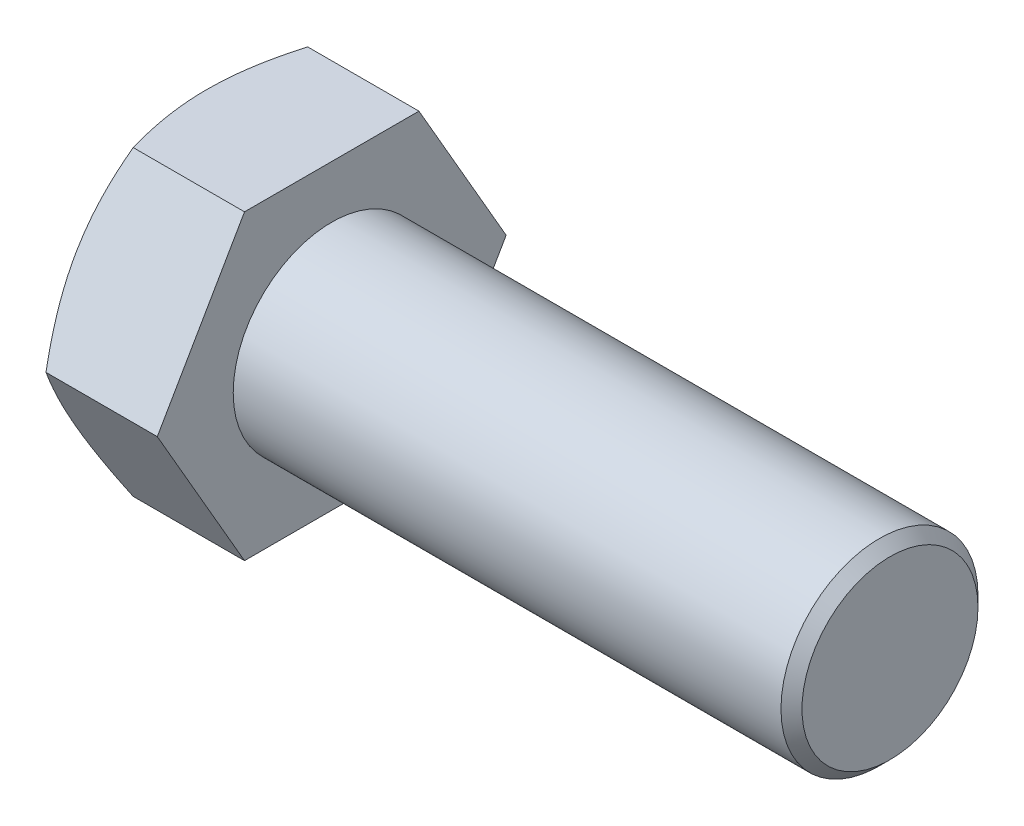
ISO-10303-21;
HEADER;
FILE_DESCRIPTION(('STEP AP214'),'2;1');
FILE_NAME('part.step','',(''),(''),'','','');
FILE_SCHEMA(('AUTOMOTIVE_DESIGN { 1 0 10303 214 1 1 1 1 }'));
ENDSEC;
DATA;
#1=APPLICATION_CONTEXT('core data for automotive mechanical design processes');
#2=APPLICATION_PROTOCOL_DEFINITION('international standard','automotive_design',2000,#1);
#3=PRODUCT_CONTEXT('',#1,'mechanical');
#4=PRODUCT('Part','Part','',(#3));
#5=PRODUCT_RELATED_PRODUCT_CATEGORY('part','',(#4));
#6=PRODUCT_DEFINITION_FORMATION('','',#4);
#7=PRODUCT_DEFINITION_CONTEXT('part definition',#1,'design');
#8=PRODUCT_DEFINITION('design','',#6,#7);
#9=PRODUCT_DEFINITION_SHAPE('','',#8);
#10=(LENGTH_UNIT() NAMED_UNIT(*) SI_UNIT(.MILLI.,.METRE.));
#11=(NAMED_UNIT(*) PLANE_ANGLE_UNIT() SI_UNIT($,.RADIAN.));
#12=(NAMED_UNIT(*) SI_UNIT($,.STERADIAN.) SOLID_ANGLE_UNIT());
#13=UNCERTAINTY_MEASURE_WITH_UNIT(LENGTH_MEASURE(1.E-05),#10,'distance_accuracy_value','');
#14=(GEOMETRIC_REPRESENTATION_CONTEXT(3) GLOBAL_UNCERTAINTY_ASSIGNED_CONTEXT((#13)) GLOBAL_UNIT_ASSIGNED_CONTEXT((#10,
#11,#12)) REPRESENTATION_CONTEXT('',''));
#15=CARTESIAN_POINT('',(0.,0.,0.));
#16=DIRECTION('',(0.,0.,1.));
#17=DIRECTION('',(1.,0.,0.));
#18=AXIS2_PLACEMENT_3D('',#15,#16,#17);
#19=CARTESIAN_POINT('',(-19.,-23.,-13.2790561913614));
#20=DIRECTION('',(0.,-0.499999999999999,-0.866025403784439));
#21=DIRECTION('',(0.,0.866025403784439,-0.499999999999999));
#22=AXIS2_PLACEMENT_3D('',#19,#20,#21);
#23=PLANE('',#22);
#24=DIRECTION('',(1.,0.,0.));
#25=VECTOR('',#24,1.);
#26=CARTESIAN_POINT('',(-19.,-23.,-13.2790561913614));
#27=LINE('',#26,#25);
#28=CARTESIAN_POINT('',(-16.9457228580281,-23.,-13.2790561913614));
#29=VERTEX_POINT('',#28);
#30=CARTESIAN_POINT('',(0.,-23.,-13.2790561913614));
#31=VERTEX_POINT('',#30);
#32=EDGE_CURVE('E239',#29,#31,#27,.T.);
#33=ORIENTED_EDGE('',*,*,#32,.F.);
#34=CARTESIAN_POINT('',(-16.9456561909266,-23.0002,-13.2789407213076));
#35=CARTESIAN_POINT('',(-17.1141540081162,-22.4946699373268,-13.5708086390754));
#36=CARTESIAN_POINT('',(-17.2750056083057,-21.9871680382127,-13.8638149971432));
#37=CARTESIAN_POINT('',(-17.5792910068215,-20.9680946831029,-14.4521772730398));
#38=CARTESIAN_POINT('',(-17.7227190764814,-20.4565219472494,-14.7475339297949));
#39=CARTESIAN_POINT('',(-17.990232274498,-19.4283073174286,-15.3411739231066));
#40=CARTESIAN_POINT('',(-18.1142712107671,-18.9116563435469,-15.6394625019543));
#41=CARTESIAN_POINT('',(-18.3403340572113,-17.874786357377,-16.2380996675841));
#42=CARTESIAN_POINT('',(-18.442360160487,-17.3545677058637,-16.5384480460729));
#43=CARTESIAN_POINT('',(-18.6200664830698,-16.3238595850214,-17.1335276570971));
#44=CARTESIAN_POINT('',(-18.6963343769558,-15.8134465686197,-17.4282147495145));
#45=CARTESIAN_POINT('',(-18.8242182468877,-14.7902817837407,-18.0189392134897));
#46=CARTESIAN_POINT('',(-18.8758337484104,-14.2775299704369,-18.3149766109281));
#47=CARTESIAN_POINT('',(-18.9531095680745,-13.2511650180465,-18.9075486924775));
#48=CARTESIAN_POINT('',(-18.9788007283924,-12.737553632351,-19.2040823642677));
#49=CARTESIAN_POINT('',(-19.0036753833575,-11.709856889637,-19.7974233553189));
#50=CARTESIAN_POINT('',(-19.0028596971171,-11.1957715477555,-20.0942306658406));
#51=CARTESIAN_POINT('',(-18.9765720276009,-10.2346805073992,-20.6491168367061));
#52=CARTESIAN_POINT('',(-18.9543055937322,-9.78760635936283,-20.9072352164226));
#53=CARTESIAN_POINT('',(-18.8901483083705,-8.89452539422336,-21.422855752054));
#54=CARTESIAN_POINT('',(-18.8482577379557,-8.44851856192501,-21.6803579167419));
#55=CARTESIAN_POINT('',(-18.7455781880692,-7.5577370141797,-22.1946508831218));
#56=CARTESIAN_POINT('',(-18.6847721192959,-7.11296378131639,-22.4514408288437));
#57=CARTESIAN_POINT('',(-18.5453377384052,-6.22554696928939,-22.9637911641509));
#58=CARTESIAN_POINT('',(-18.4667095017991,-5.78290338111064,-23.219351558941));
#59=CARTESIAN_POINT('',(-18.2020736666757,-4.43913170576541,-23.9951784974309));
#60=CARTESIAN_POINT('',(-17.9896645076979,-3.54182151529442,-24.513240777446));
#61=CARTESIAN_POINT('',(-17.6280478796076,-2.20576568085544,-25.2846129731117));
#62=CARTESIAN_POINT('',(-17.5004719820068,-1.76244815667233,-25.5405624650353));
#63=CARTESIAN_POINT('',(-17.2324046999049,-0.878879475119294,-26.0506910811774));
#64=CARTESIAN_POINT('',(-17.0919169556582,-0.438627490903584,-26.3048706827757));
#65=CARTESIAN_POINT('',(-16.9456561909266,0.000200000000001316,-26.5582278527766));
#66=B_SPLINE_CURVE_WITH_KNOTS('',3,(#34,#35,#36,#37,#38,#39,#40,#41,#42,#43,#44,#45,#46,#47,#48,
#49,#50,#51,#52,#53,#54,#55,#56,#57,#58,#59,#60,#61,#62,#63,#64,#65),.UNSPECIFIED.,.F.,.F.,(4,2,
2,2,2,2,2,2,2,2,2,2,2,2,2,4),(0.,1.8227520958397,3.64610187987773,5.47373144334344,
7.30117883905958,9.08355891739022,10.8659733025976,12.6462646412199,14.4265009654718,
15.9762768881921,17.5260306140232,19.0771885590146,20.6283399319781,23.7989683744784,
25.381520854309,26.9636285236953),.UNSPECIFIED.);
#67=CARTESIAN_POINT('',(-19.,-11.5,-19.9185842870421));
#68=VERTEX_POINT('',#67);
#69=EDGE_CURVE('E172',#29,#68,#66,.T.);
#70=ORIENTED_EDGE('',*,*,#69,.T.);
#71=CARTESIAN_POINT('',(-16.9457228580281,0.,-26.5581123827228));
#72=VERTEX_POINT('',#71);
#73=EDGE_CURVE('E166',#68,#72,#66,.T.);
#74=ORIENTED_EDGE('',*,*,#73,.T.);
#75=DIRECTION('',(1.,0.,0.));
#76=VECTOR('',#75,1.);
#77=CARTESIAN_POINT('',(-19.,0.,-26.5581123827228));
#78=LINE('',#77,#76);
#79=CARTESIAN_POINT('',(0.,0.,-26.5581123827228));
#80=VERTEX_POINT('',#79);
#81=EDGE_CURVE('E245',#72,#80,#78,.T.);
#82=ORIENTED_EDGE('',*,*,#81,.T.);
#83=DIRECTION('',(0.,0.866025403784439,-0.499999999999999));
#84=VECTOR('',#83,1.);
#85=CARTESIAN_POINT('',(0.,-23.,-13.2790561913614));
#86=LINE('',#85,#84);
#87=EDGE_CURVE('E269',#31,#80,#86,.T.);
#88=ORIENTED_EDGE('',*,*,#87,.F.);
#89=EDGE_LOOP('',(#33,#70,#74,#82,#88));
#90=FACE_BOUND('',#89,.T.);
#91=ADVANCED_FACE('F37',(#90),#23,.T.);
#92=CARTESIAN_POINT('',(-19.,-23.,13.2790561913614));
#93=DIRECTION('',(0.,-1.,0.));
#94=DIRECTION('',(0.,0.,-1.));
#95=AXIS2_PLACEMENT_3D('',#92,#93,#94);
#96=PLANE('',#95);
#97=DIRECTION('',(1.,0.,0.));
#98=VECTOR('',#97,1.);
#99=CARTESIAN_POINT('',(-19.,-23.,13.2790561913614));
#100=LINE('',#99,#98);
#101=CARTESIAN_POINT('',(-16.9457228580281,-23.,13.2790561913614));
#102=VERTEX_POINT('',#101);
#103=CARTESIAN_POINT('',(0.,-23.,13.2790561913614));
#104=VERTEX_POINT('',#103);
#105=EDGE_CURVE('E236',#102,#104,#100,.T.);
#106=ORIENTED_EDGE('',*,*,#105,.F.);
#107=CARTESIAN_POINT('',(-7.48739623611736,-23.,-36.261263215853));
#108=CARTESIAN_POINT('',(-7.73354565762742,-23.,-35.7563800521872));
#109=CARTESIAN_POINT('',(-7.97851134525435,-23.,-35.2509202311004));
#110=CARTESIAN_POINT('',(-8.46580863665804,-23.,-34.2387268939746));
#111=CARTESIAN_POINT('',(-8.70814021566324,-23.,-33.7319933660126));
#112=CARTESIAN_POINT('',(-9.43084404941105,-23.,-32.2095745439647));
#113=CARTESIAN_POINT('',(-9.90685668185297,-23.,-31.191811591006));
#114=CARTESIAN_POINT('',(-10.8469186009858,-23.,-29.14441182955));
#115=CARTESIAN_POINT('',(-11.3108936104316,-23.,-28.1147408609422));
#116=CARTESIAN_POINT('',(-12.2206502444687,-23.,-26.0474043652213));
#117=CARTESIAN_POINT('',(-12.6664326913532,-23.,-25.0097392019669));
#118=CARTESIAN_POINT('',(-13.3251922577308,-23.,-23.4283078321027));
#119=CARTESIAN_POINT('',(-13.5466205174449,-23.,-22.888058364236));
#120=CARTESIAN_POINT('',(-13.9824654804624,-23.,-21.8047417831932));
#121=CARTESIAN_POINT('',(-14.196882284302,-23.,-21.2616747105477));
#122=CARTESIAN_POINT('',(-14.6177870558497,-23.,-20.1723832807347));
#123=CARTESIAN_POINT('',(-14.8242739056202,-23.,-19.6261584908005));
#124=CARTESIAN_POINT('',(-15.2281815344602,-23.,-18.5303754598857));
#125=CARTESIAN_POINT('',(-15.4256025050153,-23.,-17.9808172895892));
#126=CARTESIAN_POINT('',(-15.8097601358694,-23.,-16.8791447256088));
#127=CARTESIAN_POINT('',(-15.996516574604,-23.,-16.3270372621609));
#128=CARTESIAN_POINT('',(-16.3583193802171,-23.,-15.2190090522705));
#129=CARTESIAN_POINT('',(-16.5333655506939,-23.,-14.6630882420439));
#130=CARTESIAN_POINT('',(-17.0385069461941,-23.,-12.9895415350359));
#131=CARTESIAN_POINT('',(-17.3487486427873,-23.,-11.8657263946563));
#132=CARTESIAN_POINT('',(-17.7625410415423,-23.,-10.1709040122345));
#133=CARTESIAN_POINT('',(-17.8915832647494,-23.,-9.60606069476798));
#134=CARTESIAN_POINT('',(-18.1309904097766,-23.,-8.47240461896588));
#135=CARTESIAN_POINT('',(-18.2413556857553,-23.,-7.90359193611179));
#136=CARTESIAN_POINT('',(-18.4414969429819,-23.,-6.76236589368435));
#137=CARTESIAN_POINT('',(-18.5312738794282,-23.,-6.18995270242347));
#138=CARTESIAN_POINT('',(-18.6884786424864,-23.,-5.04204443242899));
#139=CARTESIAN_POINT('',(-18.7559064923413,-23.,-4.46654935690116));
#140=CARTESIAN_POINT('',(-18.8661876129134,-23.,-3.32108847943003));
#141=CARTESIAN_POINT('',(-18.9093624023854,-23.,-2.75115382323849));
#142=CARTESIAN_POINT('',(-18.9715475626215,-23.,-1.60996833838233));
#143=CARTESIAN_POINT('',(-18.99055835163,-23.,-1.03871753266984));
#144=CARTESIAN_POINT('',(-19.0039602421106,-23.,0.104081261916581));
#145=CARTESIAN_POINT('',(-18.9983512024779,-23.,0.675629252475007));
#146=CARTESIAN_POINT('',(-18.9626559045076,-23.,1.81796798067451));
#147=CARTESIAN_POINT('',(-18.9325685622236,-23.,2.38875868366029));
#148=CARTESIAN_POINT('',(-18.8328155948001,-23.,3.74276967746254));
#149=CARTESIAN_POINT('',(-18.7525264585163,-23.,4.5252222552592));
#150=CARTESIAN_POINT('',(-18.550184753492,-23.,6.08471078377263));
#151=CARTESIAN_POINT('',(-18.4281270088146,-23.,6.8617460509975));
#152=CARTESIAN_POINT('',(-18.1465893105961,-23.,8.40951343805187));
#153=CARTESIAN_POINT('',(-17.9870827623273,-23.,9.18024067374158));
#154=CARTESIAN_POINT('',(-17.6355424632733,-23.,10.7141618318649));
#155=CARTESIAN_POINT('',(-17.4435090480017,-23.,11.4773558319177));
#156=CARTESIAN_POINT('',(-17.0268215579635,-23.,13.0139505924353));
#157=CARTESIAN_POINT('',(-16.8015084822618,-23.,13.7871714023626));
#158=CARTESIAN_POINT('',(-16.3263798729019,-23.,15.3260034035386));
#159=CARTESIAN_POINT('',(-16.0765641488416,-23.,16.0916145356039));
#160=CARTESIAN_POINT('',(-15.5565000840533,-23.,17.6156011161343));
#161=CARTESIAN_POINT('',(-15.2862574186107,-23.,18.3739785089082));
#162=CARTESIAN_POINT('',(-14.8680485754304,-23.,19.5067594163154));
#163=CARTESIAN_POINT('',(-14.7265056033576,-23.,19.8835535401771));
#164=CARTESIAN_POINT('',(-14.4394918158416,-23.,20.6356444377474));
#165=CARTESIAN_POINT('',(-14.2940209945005,-23.,21.0109412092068));
#166=CARTESIAN_POINT('',(-13.8940127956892,-23.,22.0284195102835));
#167=CARTESIAN_POINT('',(-13.6359834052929,-23.,22.6692292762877));
#168=CARTESIAN_POINT('',(-13.1108265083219,-23.,23.9471174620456));
#169=CARTESIAN_POINT('',(-12.8436987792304,-23.,24.5841957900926));
#170=CARTESIAN_POINT('',(-12.3015656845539,-23.,25.8550522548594));
#171=CARTESIAN_POINT('',(-12.026559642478,-23.,26.48883010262));
#172=CARTESIAN_POINT('',(-11.4697355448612,-23.,27.7533904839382));
#173=CARTESIAN_POINT('',(-11.1879174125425,-23.,28.3841729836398));
#174=CARTESIAN_POINT('',(-10.6182482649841,-23.,29.6432932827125));
#175=CARTESIAN_POINT('',(-10.3303950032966,-23.,30.2716300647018));
#176=CARTESIAN_POINT('',(-9.7495013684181,-23.,31.5259030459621));
#177=CARTESIAN_POINT('',(-9.45646096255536,-23.,32.1518392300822));
#178=CARTESIAN_POINT('',(-8.57056874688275,-23.,34.0263673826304));
#179=CARTESIAN_POINT('',(-7.97091511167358,-23.,35.27174670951));
#180=CARTESIAN_POINT('',(-6.75651841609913,-23.,37.7576286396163));
#181=CARTESIAN_POINT('',(-6.1417522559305,-23.,38.9981199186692));
#182=CARTESIAN_POINT('',(-4.90100524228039,-23.,41.4734876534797));
#183=CARTESIAN_POINT('',(-4.27502429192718,-23.,42.7083640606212));
#184=CARTESIAN_POINT('',(-3.01420487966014,-23.,45.1732321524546));
#185=CARTESIAN_POINT('',(-2.37936842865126,-23.,46.4032248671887));
#186=CARTESIAN_POINT('',(-1.10237855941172,-23.,48.8593975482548));
#187=CARTESIAN_POINT('',(-0.460225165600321,-23.,50.0855775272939));
#188=CARTESIAN_POINT('',(0.761157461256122,-23.,52.4038849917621));
#189=CARTESIAN_POINT('',(1.33977706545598,-23.,53.4963339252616));
#190=CARTESIAN_POINT('',(2.50110248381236,-23.,55.6790584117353));
#191=CARTESIAN_POINT('',(3.08380830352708,-23.,56.7693339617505));
#192=CARTESIAN_POINT('',(4.83720692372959,-23.,60.0374991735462));
#193=CARTESIAN_POINT('',(6.01311044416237,-23.,62.2125940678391));
#194=CARTESIAN_POINT('',(7.78271585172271,-23.,65.4673040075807));
#195=CARTESIAN_POINT('',(8.37252764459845,-23.,66.5490393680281));
#196=CARTESIAN_POINT('',(9.55441403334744,-23.,68.711274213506));
#197=CARTESIAN_POINT('',(10.1464886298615,-23.,69.7917736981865));
#198=CARTESIAN_POINT('',(11.3325686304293,-23.,71.9515989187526));
#199=CARTESIAN_POINT('',(11.9265738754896,-23.,73.0309247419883));
#200=CARTESIAN_POINT('',(13.1163368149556,-23.,75.188608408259));
#201=CARTESIAN_POINT('',(13.7120945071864,-23.,76.2669662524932));
#202=CARTESIAN_POINT('',(14.3086163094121,-23.,77.344900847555));
#203=B_SPLINE_CURVE_WITH_KNOTS('',3,(#107,#108,#109,#110,#111,#112,#113,#114,#115,#116,#117,
#118,#119,#120,#121,#122,#123,#124,#125,#126,#127,#128,#129,#130,#131,#132,#133,#134,#135,#136,
#137,#138,#139,#140,#141,#142,#143,#144,#145,#146,#147,#148,#149,#150,#151,#152,#153,#154,#155,
#156,#157,#158,#159,#160,#161,#162,#163,#164,#165,#166,#167,#168,#169,#170,#171,#172,#173,#174,
#175,#176,#177,#178,#179,#180,#181,#182,#183,#184,#185,#186,#187,#188,#189,#190,#191,#192,#193,
#194,#195,#196,#197,#198,#199,#200,#201,#202),.UNSPECIFIED.,.F.,.F.,(4,2,2,2,2,2,2,2,2,2,2,2,2,
2,2,2,2,2,2,2,2,2,2,2,2,2,2,2,2,2,2,2,2,2,2,2,2,2,2,2,2,2,2,2,2,2,2,4),(0.,1.68506916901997,
3.37015417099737,6.74079357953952,10.12879996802,13.5166530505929,15.2682126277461,
17.0197470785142,18.7715275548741,20.5232710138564,22.2716524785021,24.0200632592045,
27.5155968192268,29.2535370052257,30.9914442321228,32.7292708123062,34.4670955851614,
36.1813030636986,37.8954808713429,39.6096685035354,41.3239320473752,43.6823245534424,
46.0410094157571,48.4013744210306,50.7617150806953,53.1773703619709,55.5930444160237,
58.0080497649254,59.2155396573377,60.4230313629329,62.4953687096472,64.5677567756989,
66.6403233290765,68.7129132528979,70.7862888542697,72.8596775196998,77.006231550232,
81.1595751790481,85.3129547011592,89.4654059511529,93.6178433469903,97.3265000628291,
101.035161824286,108.452937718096,112.149186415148,115.84543615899,119.541388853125,
123.237336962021),.UNSPECIFIED.);
#204=CARTESIAN_POINT('',(-19.,-23.,0.));
#205=VERTEX_POINT('',#204);
#206=EDGE_CURVE('E221',#102,#205,#203,.F.);
#207=ORIENTED_EDGE('',*,*,#206,.T.);
#208=EDGE_CURVE('E180',#205,#29,#203,.F.);
#209=ORIENTED_EDGE('',*,*,#208,.T.);
#210=ORIENTED_EDGE('',*,*,#32,.T.);
#211=DIRECTION('',(0.,0.,-1.));
#212=VECTOR('',#211,1.);
#213=CARTESIAN_POINT('',(0.,-23.,13.2790561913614));
#214=LINE('',#213,#212);
#215=EDGE_CURVE('E247',#104,#31,#214,.T.);
#216=ORIENTED_EDGE('',*,*,#215,.F.);
#217=EDGE_LOOP('',(#106,#207,#209,#210,#216));
#218=FACE_BOUND('',#217,.T.);
#219=ADVANCED_FACE('F163',(#218),#96,.T.);
#220=CARTESIAN_POINT('',(-19.,-23.,13.2790561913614));
#221=DIRECTION('',(0.,0.499999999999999,-0.866025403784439));
#222=DIRECTION('',(0.,0.866025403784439,0.499999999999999));
#223=AXIS2_PLACEMENT_3D('',#220,#221,#222);
#224=PLANE('',#223);
#225=CARTESIAN_POINT('',(-16.9456561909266,-23.0002,13.2789407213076));
#226=CARTESIAN_POINT('',(-17.1141540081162,-22.4946699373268,13.5708086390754));
#227=CARTESIAN_POINT('',(-17.2750056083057,-21.9871680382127,13.8638149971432));
#228=CARTESIAN_POINT('',(-17.5792910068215,-20.9680946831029,14.4521772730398));
#229=CARTESIAN_POINT('',(-17.7227190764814,-20.4565219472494,14.7475339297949));
#230=CARTESIAN_POINT('',(-17.990232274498,-19.4283073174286,15.3411739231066));
#231=CARTESIAN_POINT('',(-18.1142712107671,-18.9116563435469,15.6394625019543));
#232=CARTESIAN_POINT('',(-18.3403340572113,-17.874786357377,16.2380996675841));
#233=CARTESIAN_POINT('',(-18.442360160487,-17.3545677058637,16.5384480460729));
#234=CARTESIAN_POINT('',(-18.6200664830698,-16.3238595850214,17.1335276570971));
#235=CARTESIAN_POINT('',(-18.6963343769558,-15.8134465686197,17.4282147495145));
#236=CARTESIAN_POINT('',(-18.8242182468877,-14.7902817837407,18.0189392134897));
#237=CARTESIAN_POINT('',(-18.8758337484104,-14.2775299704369,18.3149766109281));
#238=CARTESIAN_POINT('',(-18.9531095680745,-13.2511650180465,18.9075486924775));
#239=CARTESIAN_POINT('',(-18.9788007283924,-12.737553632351,19.2040823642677));
#240=CARTESIAN_POINT('',(-19.0036753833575,-11.709856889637,19.7974233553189));
#241=CARTESIAN_POINT('',(-19.0028596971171,-11.1957715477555,20.0942306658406));
#242=CARTESIAN_POINT('',(-18.9765720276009,-10.2346805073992,20.6491168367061));
#243=CARTESIAN_POINT('',(-18.9543055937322,-9.78760635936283,20.9072352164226));
#244=CARTESIAN_POINT('',(-18.8901483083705,-8.89452539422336,21.422855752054));
#245=CARTESIAN_POINT('',(-18.8482577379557,-8.44851856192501,21.6803579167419));
#246=CARTESIAN_POINT('',(-18.7455781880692,-7.5577370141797,22.1946508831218));
#247=CARTESIAN_POINT('',(-18.6847721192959,-7.11296378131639,22.4514408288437));
#248=CARTESIAN_POINT('',(-18.5453377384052,-6.22554696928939,22.9637911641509));
#249=CARTESIAN_POINT('',(-18.4667095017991,-5.78290338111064,23.219351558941));
#250=CARTESIAN_POINT('',(-18.2020736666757,-4.43913170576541,23.9951784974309));
#251=CARTESIAN_POINT('',(-17.9896645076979,-3.54182151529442,24.513240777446));
#252=CARTESIAN_POINT('',(-17.6280478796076,-2.20576568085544,25.2846129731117));
#253=CARTESIAN_POINT('',(-17.5004719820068,-1.76244815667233,25.5405624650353));
#254=CARTESIAN_POINT('',(-17.2324046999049,-0.878879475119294,26.0506910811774));
#255=CARTESIAN_POINT('',(-17.0919169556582,-0.438627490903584,26.3048706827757));
#256=CARTESIAN_POINT('',(-16.9456561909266,0.000200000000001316,26.5582278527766));
#257=B_SPLINE_CURVE_WITH_KNOTS('',3,(#225,#226,#227,#228,#229,#230,#231,#232,#233,#234,#235,
#236,#237,#238,#239,#240,#241,#242,#243,#244,#245,#246,#247,#248,#249,#250,#251,#252,#253,#254,
#255,#256),.UNSPECIFIED.,.F.,.F.,(4,2,2,2,2,2,2,2,2,2,2,2,2,2,2,4),(0.,1.8227520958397,
3.64610187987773,5.47373144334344,7.30117883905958,9.08355891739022,10.8659733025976,
12.6462646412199,14.4265009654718,15.9762768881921,17.5260306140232,19.0771885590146,
20.6283399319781,23.7989683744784,25.381520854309,26.9636285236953),.UNSPECIFIED.);
#258=CARTESIAN_POINT('',(-19.,-11.5,19.9185842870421));
#259=VERTEX_POINT('',#258);
#260=EDGE_CURVE('E178',#102,#259,#257,.T.);
#261=ORIENTED_EDGE('',*,*,#260,.F.);
#262=ORIENTED_EDGE('',*,*,#105,.T.);
#263=DIRECTION('',(0.,0.866025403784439,0.499999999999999));
#264=VECTOR('',#263,1.);
#265=CARTESIAN_POINT('',(0.,-23.,13.2790561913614));
#266=LINE('',#265,#264);
#267=CARTESIAN_POINT('',(0.,0.,26.5581123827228));
#268=VERTEX_POINT('',#267);
#269=EDGE_CURVE('E232',#104,#268,#266,.T.);
#270=ORIENTED_EDGE('',*,*,#269,.T.);
#271=DIRECTION('',(1.,0.,0.));
#272=VECTOR('',#271,1.);
#273=CARTESIAN_POINT('',(-19.,0.,26.5581123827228));
#274=LINE('',#273,#272);
#275=CARTESIAN_POINT('',(-16.9457228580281,0.,26.5581123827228));
#276=VERTEX_POINT('',#275);
#277=EDGE_CURVE('E230',#276,#268,#274,.T.);
#278=ORIENTED_EDGE('',*,*,#277,.F.);
#279=EDGE_CURVE('E173',#259,#276,#257,.T.);
#280=ORIENTED_EDGE('',*,*,#279,.F.);
#281=EDGE_LOOP('',(#261,#262,#270,#278,#280));
#282=FACE_BOUND('',#281,.T.);
#283=ADVANCED_FACE('F186',(#282),#224,.F.);
#284=CARTESIAN_POINT('',(-19.,23.,13.2790561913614));
#285=DIRECTION('',(0.,0.499999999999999,0.866025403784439));
#286=DIRECTION('',(0.,-0.866025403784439,0.499999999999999));
#287=AXIS2_PLACEMENT_3D('',#284,#285,#286);
#288=PLANE('',#287);
#289=DIRECTION('',(1.,0.,0.));
#290=VECTOR('',#289,1.);
#291=CARTESIAN_POINT('',(-19.,23.,13.2790561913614));
#292=LINE('',#291,#290);
#293=CARTESIAN_POINT('',(-16.9457228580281,23.,13.2790561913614));
#294=VERTEX_POINT('',#293);
#295=CARTESIAN_POINT('',(0.,23.,13.2790561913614));
#296=VERTEX_POINT('',#295);
#297=EDGE_CURVE('E237',#294,#296,#292,.T.);
#298=ORIENTED_EDGE('',*,*,#297,.F.);
#299=CARTESIAN_POINT('',(-16.9456561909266,23.0002,13.2789407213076));
#300=CARTESIAN_POINT('',(-17.1141540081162,22.4946699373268,13.5708086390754));
#301=CARTESIAN_POINT('',(-17.2750056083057,21.9871680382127,13.8638149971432));
#302=CARTESIAN_POINT('',(-17.5792910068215,20.9680946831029,14.4521772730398));
#303=CARTESIAN_POINT('',(-17.7227190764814,20.4565219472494,14.7475339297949));
#304=CARTESIAN_POINT('',(-17.990232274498,19.4283073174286,15.3411739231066));
#305=CARTESIAN_POINT('',(-18.1142712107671,18.9116563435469,15.6394625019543));
#306=CARTESIAN_POINT('',(-18.3403340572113,17.874786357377,16.2380996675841));
#307=CARTESIAN_POINT('',(-18.442360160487,17.3545677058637,16.5384480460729));
#308=CARTESIAN_POINT('',(-18.6200664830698,16.3238595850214,17.1335276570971));
#309=CARTESIAN_POINT('',(-18.6963343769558,15.8134465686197,17.4282147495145));
#310=CARTESIAN_POINT('',(-18.8242182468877,14.7902817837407,18.0189392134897));
#311=CARTESIAN_POINT('',(-18.8758337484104,14.2775299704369,18.3149766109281));
#312=CARTESIAN_POINT('',(-18.9531095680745,13.2511650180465,18.9075486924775));
#313=CARTESIAN_POINT('',(-18.9788007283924,12.737553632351,19.2040823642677));
#314=CARTESIAN_POINT('',(-19.0036753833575,11.709856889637,19.7974233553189));
#315=CARTESIAN_POINT('',(-19.0028596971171,11.1957715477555,20.0942306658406));
#316=CARTESIAN_POINT('',(-18.9765720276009,10.2346805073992,20.6491168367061));
#317=CARTESIAN_POINT('',(-18.9543055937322,9.78760635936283,20.9072352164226));
#318=CARTESIAN_POINT('',(-18.8901483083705,8.89452539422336,21.422855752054));
#319=CARTESIAN_POINT('',(-18.8482577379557,8.44851856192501,21.6803579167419));
#320=CARTESIAN_POINT('',(-18.7455781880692,7.5577370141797,22.1946508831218));
#321=CARTESIAN_POINT('',(-18.6847721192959,7.11296378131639,22.4514408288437));
#322=CARTESIAN_POINT('',(-18.5453377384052,6.22554696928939,22.9637911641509));
#323=CARTESIAN_POINT('',(-18.4667095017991,5.78290338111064,23.219351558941));
#324=CARTESIAN_POINT('',(-18.2020736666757,4.43913170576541,23.9951784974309));
#325=CARTESIAN_POINT('',(-17.9896645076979,3.54182151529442,24.513240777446));
#326=CARTESIAN_POINT('',(-17.6280478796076,2.20576568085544,25.2846129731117));
#327=CARTESIAN_POINT('',(-17.5004719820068,1.76244815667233,25.5405624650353));
#328=CARTESIAN_POINT('',(-17.2324046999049,0.878879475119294,26.0506910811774));
#329=CARTESIAN_POINT('',(-17.0919169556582,0.438627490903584,26.3048706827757));
#330=CARTESIAN_POINT('',(-16.9456561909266,-0.000200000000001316,26.5582278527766));
#331=B_SPLINE_CURVE_WITH_KNOTS('',3,(#299,#300,#301,#302,#303,#304,#305,#306,#307,#308,#309,
#310,#311,#312,#313,#314,#315,#316,#317,#318,#319,#320,#321,#322,#323,#324,#325,#326,#327,#328,
#329,#330),.UNSPECIFIED.,.F.,.F.,(4,2,2,2,2,2,2,2,2,2,2,2,2,2,2,4),(0.,1.8227520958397,
3.64610187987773,5.47373144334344,7.30117883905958,9.08355891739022,10.8659733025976,
12.6462646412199,14.4265009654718,15.9762768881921,17.5260306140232,19.0771885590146,
20.6283399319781,23.7989683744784,25.381520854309,26.9636285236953),.UNSPECIFIED.);
#332=CARTESIAN_POINT('',(-19.,11.5,19.9185842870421));
#333=VERTEX_POINT('',#332);
#334=EDGE_CURVE('E109',#294,#333,#331,.T.);
#335=ORIENTED_EDGE('',*,*,#334,.T.);
#336=EDGE_CURVE('E179',#333,#276,#331,.T.);
#337=ORIENTED_EDGE('',*,*,#336,.T.);
#338=ORIENTED_EDGE('',*,*,#277,.T.);
#339=DIRECTION('',(0.,-0.866025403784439,0.499999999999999));
#340=VECTOR('',#339,1.);
#341=CARTESIAN_POINT('',(0.,23.,13.2790561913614));
#342=LINE('',#341,#340);
#343=EDGE_CURVE('E279',#296,#268,#342,.T.);
#344=ORIENTED_EDGE('',*,*,#343,.F.);
#345=EDGE_LOOP('',(#298,#335,#337,#338,#344));
#346=FACE_BOUND('',#345,.T.);
#347=ADVANCED_FACE('F152',(#346),#288,.T.);
#348=CARTESIAN_POINT('',(-19.,23.,13.2790561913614));
#349=DIRECTION('',(0.,-1.,0.));
#350=DIRECTION('',(0.,0.,-1.));
#351=AXIS2_PLACEMENT_3D('',#348,#349,#350);
#352=PLANE('',#351);
#353=CARTESIAN_POINT('',(-7.48739623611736,23.,-36.261263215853));
#354=CARTESIAN_POINT('',(-7.73354565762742,23.,-35.7563800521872));
#355=CARTESIAN_POINT('',(-7.97851134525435,23.,-35.2509202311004));
#356=CARTESIAN_POINT('',(-8.46580863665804,23.,-34.2387268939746));
#357=CARTESIAN_POINT('',(-8.70814021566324,23.,-33.7319933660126));
#358=CARTESIAN_POINT('',(-9.43084404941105,23.,-32.2095745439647));
#359=CARTESIAN_POINT('',(-9.90685668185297,23.,-31.191811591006));
#360=CARTESIAN_POINT('',(-10.8469186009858,23.,-29.14441182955));
#361=CARTESIAN_POINT('',(-11.3108936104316,23.,-28.1147408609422));
#362=CARTESIAN_POINT('',(-12.2206502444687,23.,-26.0474043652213));
#363=CARTESIAN_POINT('',(-12.6664326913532,23.,-25.0097392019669));
#364=CARTESIAN_POINT('',(-13.3251922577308,23.,-23.4283078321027));
#365=CARTESIAN_POINT('',(-13.5466205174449,23.,-22.888058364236));
#366=CARTESIAN_POINT('',(-13.9824654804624,23.,-21.8047417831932));
#367=CARTESIAN_POINT('',(-14.196882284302,23.,-21.2616747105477));
#368=CARTESIAN_POINT('',(-14.6177870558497,23.,-20.1723832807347));
#369=CARTESIAN_POINT('',(-14.8242739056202,23.,-19.6261584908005));
#370=CARTESIAN_POINT('',(-15.2281815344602,23.,-18.5303754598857));
#371=CARTESIAN_POINT('',(-15.4256025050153,23.,-17.9808172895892));
#372=CARTESIAN_POINT('',(-15.8097601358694,23.,-16.8791447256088));
#373=CARTESIAN_POINT('',(-15.996516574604,23.,-16.3270372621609));
#374=CARTESIAN_POINT('',(-16.3583193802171,23.,-15.2190090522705));
#375=CARTESIAN_POINT('',(-16.5333655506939,23.,-14.6630882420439));
#376=CARTESIAN_POINT('',(-17.0385069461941,23.,-12.9895415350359));
#377=CARTESIAN_POINT('',(-17.3487486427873,23.,-11.8657263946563));
#378=CARTESIAN_POINT('',(-17.7625410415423,23.,-10.1709040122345));
#379=CARTESIAN_POINT('',(-17.8915832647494,23.,-9.60606069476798));
#380=CARTESIAN_POINT('',(-18.1309904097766,23.,-8.47240461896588));
#381=CARTESIAN_POINT('',(-18.2413556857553,23.,-7.90359193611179));
#382=CARTESIAN_POINT('',(-18.4414969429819,23.,-6.76236589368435));
#383=CARTESIAN_POINT('',(-18.5312738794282,23.,-6.18995270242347));
#384=CARTESIAN_POINT('',(-18.6884786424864,23.,-5.04204443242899));
#385=CARTESIAN_POINT('',(-18.7559064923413,23.,-4.46654935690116));
#386=CARTESIAN_POINT('',(-18.8661876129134,23.,-3.32108847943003));
#387=CARTESIAN_POINT('',(-18.9093624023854,23.,-2.75115382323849));
#388=CARTESIAN_POINT('',(-18.9715475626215,23.,-1.60996833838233));
#389=CARTESIAN_POINT('',(-18.99055835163,23.,-1.03871753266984));
#390=CARTESIAN_POINT('',(-19.0039602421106,23.,0.104081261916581));
#391=CARTESIAN_POINT('',(-18.9983512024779,23.,0.675629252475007));
#392=CARTESIAN_POINT('',(-18.9626559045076,23.,1.81796798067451));
#393=CARTESIAN_POINT('',(-18.9325685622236,23.,2.38875868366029));
#394=CARTESIAN_POINT('',(-18.8328155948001,23.,3.74276967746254));
#395=CARTESIAN_POINT('',(-18.7525264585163,23.,4.5252222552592));
#396=CARTESIAN_POINT('',(-18.550184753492,23.,6.08471078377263));
#397=CARTESIAN_POINT('',(-18.4281270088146,23.,6.8617460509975));
#398=CARTESIAN_POINT('',(-18.1465893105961,23.,8.40951343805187));
#399=CARTESIAN_POINT('',(-17.9870827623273,23.,9.18024067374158));
#400=CARTESIAN_POINT('',(-17.6355424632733,23.,10.7141618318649));
#401=CARTESIAN_POINT('',(-17.4435090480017,23.,11.4773558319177));
#402=CARTESIAN_POINT('',(-17.0268215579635,23.,13.0139505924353));
#403=CARTESIAN_POINT('',(-16.8015084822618,23.,13.7871714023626));
#404=CARTESIAN_POINT('',(-16.3263798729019,23.,15.3260034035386));
#405=CARTESIAN_POINT('',(-16.0765641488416,23.,16.0916145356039));
#406=CARTESIAN_POINT('',(-15.5565000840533,23.,17.6156011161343));
#407=CARTESIAN_POINT('',(-15.2862574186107,23.,18.3739785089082));
#408=CARTESIAN_POINT('',(-14.8680485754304,23.,19.5067594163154));
#409=CARTESIAN_POINT('',(-14.7265056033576,23.,19.8835535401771));
#410=CARTESIAN_POINT('',(-14.4394918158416,23.,20.6356444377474));
#411=CARTESIAN_POINT('',(-14.2940209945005,23.,21.0109412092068));
#412=CARTESIAN_POINT('',(-13.8940127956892,23.,22.0284195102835));
#413=CARTESIAN_POINT('',(-13.6359834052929,23.,22.6692292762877));
#414=CARTESIAN_POINT('',(-13.1108265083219,23.,23.9471174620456));
#415=CARTESIAN_POINT('',(-12.8436987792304,23.,24.5841957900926));
#416=CARTESIAN_POINT('',(-12.3015656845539,23.,25.8550522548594));
#417=CARTESIAN_POINT('',(-12.026559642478,23.,26.48883010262));
#418=CARTESIAN_POINT('',(-11.4697355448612,23.,27.7533904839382));
#419=CARTESIAN_POINT('',(-11.1879174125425,23.,28.3841729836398));
#420=CARTESIAN_POINT('',(-10.6182482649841,23.,29.6432932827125));
#421=CARTESIAN_POINT('',(-10.3303950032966,23.,30.2716300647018));
#422=CARTESIAN_POINT('',(-9.7495013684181,23.,31.5259030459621));
#423=CARTESIAN_POINT('',(-9.45646096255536,23.,32.1518392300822));
#424=CARTESIAN_POINT('',(-8.57056874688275,23.,34.0263673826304));
#425=CARTESIAN_POINT('',(-7.97091511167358,23.,35.27174670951));
#426=CARTESIAN_POINT('',(-6.75651841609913,23.,37.7576286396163));
#427=CARTESIAN_POINT('',(-6.1417522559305,23.,38.9981199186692));
#428=CARTESIAN_POINT('',(-4.90100524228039,23.,41.4734876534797));
#429=CARTESIAN_POINT('',(-4.27502429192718,23.,42.7083640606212));
#430=CARTESIAN_POINT('',(-3.01420487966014,23.,45.1732321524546));
#431=CARTESIAN_POINT('',(-2.37936842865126,23.,46.4032248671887));
#432=CARTESIAN_POINT('',(-1.10237855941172,23.,48.8593975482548));
#433=CARTESIAN_POINT('',(-0.460225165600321,23.,50.0855775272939));
#434=CARTESIAN_POINT('',(0.761157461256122,23.,52.4038849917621));
#435=CARTESIAN_POINT('',(1.33977706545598,23.,53.4963339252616));
#436=CARTESIAN_POINT('',(2.50110248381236,23.,55.6790584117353));
#437=CARTESIAN_POINT('',(3.08380830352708,23.,56.7693339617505));
#438=CARTESIAN_POINT('',(4.83720692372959,23.,60.0374991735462));
#439=CARTESIAN_POINT('',(6.01311044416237,23.,62.2125940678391));
#440=CARTESIAN_POINT('',(7.78271585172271,23.,65.4673040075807));
#441=CARTESIAN_POINT('',(8.37252764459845,23.,66.5490393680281));
#442=CARTESIAN_POINT('',(9.55441403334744,23.,68.711274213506));
#443=CARTESIAN_POINT('',(10.1464886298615,23.,69.7917736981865));
#444=CARTESIAN_POINT('',(11.3325686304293,23.,71.9515989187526));
#445=CARTESIAN_POINT('',(11.9265738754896,23.,73.0309247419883));
#446=CARTESIAN_POINT('',(13.1163368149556,23.,75.188608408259));
#447=CARTESIAN_POINT('',(13.7120945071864,23.,76.2669662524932));
#448=CARTESIAN_POINT('',(14.3086163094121,23.,77.344900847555));
#449=B_SPLINE_CURVE_WITH_KNOTS('',3,(#353,#354,#355,#356,#357,#358,#359,#360,#361,#362,#363,
#364,#365,#366,#367,#368,#369,#370,#371,#372,#373,#374,#375,#376,#377,#378,#379,#380,#381,#382,
#383,#384,#385,#386,#387,#388,#389,#390,#391,#392,#393,#394,#395,#396,#397,#398,#399,#400,#401,
#402,#403,#404,#405,#406,#407,#408,#409,#410,#411,#412,#413,#414,#415,#416,#417,#418,#419,#420,
#421,#422,#423,#424,#425,#426,#427,#428,#429,#430,#431,#432,#433,#434,#435,#436,#437,#438,#439,
#440,#441,#442,#443,#444,#445,#446,#447,#448),.UNSPECIFIED.,.F.,.F.,(4,2,2,2,2,2,2,2,2,2,2,2,2,
2,2,2,2,2,2,2,2,2,2,2,2,2,2,2,2,2,2,2,2,2,2,2,2,2,2,2,2,2,2,2,2,2,2,4),(0.,1.68506916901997,
3.37015417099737,6.74079357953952,10.12879996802,13.5166530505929,15.2682126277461,
17.0197470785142,18.7715275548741,20.5232710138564,22.2716524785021,24.0200632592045,
27.5155968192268,29.2535370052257,30.9914442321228,32.7292708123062,34.4670955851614,
36.1813030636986,37.8954808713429,39.6096685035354,41.3239320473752,43.6823245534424,
46.0410094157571,48.4013744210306,50.7617150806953,53.1773703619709,55.5930444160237,
58.0080497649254,59.2155396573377,60.4230313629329,62.4953687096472,64.5677567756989,
66.6403233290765,68.7129132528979,70.7862888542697,72.8596775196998,77.006231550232,
81.1595751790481,85.3129547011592,89.4654059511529,93.6178433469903,97.3265000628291,
101.035161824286,108.452937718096,112.149186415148,115.84543615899,119.541388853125,
123.237336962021),.UNSPECIFIED.);
#450=CARTESIAN_POINT('',(-19.,23.,0.));
#451=VERTEX_POINT('',#450);
#452=EDGE_CURVE('E106',#294,#451,#449,.F.);
#453=ORIENTED_EDGE('',*,*,#452,.F.);
#454=ORIENTED_EDGE('',*,*,#297,.T.);
#455=DIRECTION('',(0.,0.,-1.));
#456=VECTOR('',#455,1.);
#457=CARTESIAN_POINT('',(0.,23.,13.2790561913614));
#458=LINE('',#457,#456);
#459=CARTESIAN_POINT('',(0.,23.,-13.2790561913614));
#460=VERTEX_POINT('',#459);
#461=EDGE_CURVE('E275',#296,#460,#458,.T.);
#462=ORIENTED_EDGE('',*,*,#461,.T.);
#463=DIRECTION('',(1.,0.,0.));
#464=VECTOR('',#463,1.);
#465=CARTESIAN_POINT('',(-19.,23.,-13.2790561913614));
#466=LINE('',#465,#464);
#467=CARTESIAN_POINT('',(-16.9457228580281,23.,-13.2790561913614));
#468=VERTEX_POINT('',#467);
#469=EDGE_CURVE('E130',#468,#460,#466,.T.);
#470=ORIENTED_EDGE('',*,*,#469,.F.);
#471=EDGE_CURVE('E113',#451,#468,#449,.F.);
#472=ORIENTED_EDGE('',*,*,#471,.F.);
#473=EDGE_LOOP('',(#453,#454,#462,#470,#472));
#474=FACE_BOUND('',#473,.T.);
#475=ADVANCED_FACE('F128',(#474),#352,.F.);
#476=CARTESIAN_POINT('',(-19.,23.,-13.2790561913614));
#477=DIRECTION('',(0.,-0.499999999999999,0.866025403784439));
#478=DIRECTION('',(0.,-0.866025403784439,-0.499999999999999));
#479=AXIS2_PLACEMENT_3D('',#476,#477,#478);
#480=PLANE('',#479);
#481=CARTESIAN_POINT('',(-16.9456561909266,23.0002,-13.2789407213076));
#482=CARTESIAN_POINT('',(-17.1141540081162,22.4946699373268,-13.5708086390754));
#483=CARTESIAN_POINT('',(-17.2750056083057,21.9871680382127,-13.8638149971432));
#484=CARTESIAN_POINT('',(-17.5792910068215,20.9680946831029,-14.4521772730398));
#485=CARTESIAN_POINT('',(-17.7227190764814,20.4565219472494,-14.7475339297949));
#486=CARTESIAN_POINT('',(-17.990232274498,19.4283073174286,-15.3411739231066));
#487=CARTESIAN_POINT('',(-18.1142712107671,18.9116563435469,-15.6394625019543));
#488=CARTESIAN_POINT('',(-18.3403340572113,17.874786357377,-16.2380996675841));
#489=CARTESIAN_POINT('',(-18.442360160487,17.3545677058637,-16.5384480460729));
#490=CARTESIAN_POINT('',(-18.6200664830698,16.3238595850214,-17.1335276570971));
#491=CARTESIAN_POINT('',(-18.6963343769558,15.8134465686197,-17.4282147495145));
#492=CARTESIAN_POINT('',(-18.8242182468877,14.7902817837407,-18.0189392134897));
#493=CARTESIAN_POINT('',(-18.8758337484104,14.2775299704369,-18.3149766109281));
#494=CARTESIAN_POINT('',(-18.9531095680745,13.2511650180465,-18.9075486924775));
#495=CARTESIAN_POINT('',(-18.9788007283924,12.737553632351,-19.2040823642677));
#496=CARTESIAN_POINT('',(-19.0036753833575,11.709856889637,-19.7974233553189));
#497=CARTESIAN_POINT('',(-19.0028596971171,11.1957715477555,-20.0942306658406));
#498=CARTESIAN_POINT('',(-18.9765720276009,10.2346805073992,-20.6491168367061));
#499=CARTESIAN_POINT('',(-18.9543055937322,9.78760635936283,-20.9072352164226));
#500=CARTESIAN_POINT('',(-18.8901483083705,8.89452539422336,-21.422855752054));
#501=CARTESIAN_POINT('',(-18.8482577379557,8.44851856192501,-21.6803579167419));
#502=CARTESIAN_POINT('',(-18.7455781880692,7.5577370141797,-22.1946508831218));
#503=CARTESIAN_POINT('',(-18.6847721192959,7.11296378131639,-22.4514408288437));
#504=CARTESIAN_POINT('',(-18.5453377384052,6.22554696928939,-22.9637911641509));
#505=CARTESIAN_POINT('',(-18.4667095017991,5.78290338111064,-23.219351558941));
#506=CARTESIAN_POINT('',(-18.2020736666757,4.43913170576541,-23.9951784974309));
#507=CARTESIAN_POINT('',(-17.9896645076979,3.54182151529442,-24.513240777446));
#508=CARTESIAN_POINT('',(-17.6280478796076,2.20576568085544,-25.2846129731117));
#509=CARTESIAN_POINT('',(-17.5004719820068,1.76244815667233,-25.5405624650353));
#510=CARTESIAN_POINT('',(-17.2324046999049,0.878879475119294,-26.0506910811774));
#511=CARTESIAN_POINT('',(-17.0919169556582,0.438627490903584,-26.3048706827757));
#512=CARTESIAN_POINT('',(-16.9456561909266,-0.000200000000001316,-26.5582278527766));
#513=B_SPLINE_CURVE_WITH_KNOTS('',3,(#481,#482,#483,#484,#485,#486,#487,#488,#489,#490,#491,
#492,#493,#494,#495,#496,#497,#498,#499,#500,#501,#502,#503,#504,#505,#506,#507,#508,#509,#510,
#511,#512),.UNSPECIFIED.,.F.,.F.,(4,2,2,2,2,2,2,2,2,2,2,2,2,2,2,4),(0.,1.8227520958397,
3.64610187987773,5.47373144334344,7.30117883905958,9.08355891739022,10.8659733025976,
12.6462646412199,14.4265009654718,15.9762768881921,17.5260306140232,19.0771885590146,
20.6283399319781,23.7989683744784,25.381520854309,26.9636285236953),.UNSPECIFIED.);
#514=CARTESIAN_POINT('',(-19.,11.5,-19.9185842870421));
#515=VERTEX_POINT('',#514);
#516=EDGE_CURVE('E119',#468,#515,#513,.T.);
#517=ORIENTED_EDGE('',*,*,#516,.F.);
#518=ORIENTED_EDGE('',*,*,#469,.T.);
#519=DIRECTION('',(0.,-0.866025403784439,-0.499999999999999));
#520=VECTOR('',#519,1.);
#521=CARTESIAN_POINT('',(0.,23.,-13.2790561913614));
#522=LINE('',#521,#520);
#523=EDGE_CURVE('E272',#460,#80,#522,.T.);
#524=ORIENTED_EDGE('',*,*,#523,.T.);
#525=ORIENTED_EDGE('',*,*,#81,.F.);
#526=EDGE_CURVE('E121',#515,#72,#513,.T.);
#527=ORIENTED_EDGE('',*,*,#526,.F.);
#528=EDGE_LOOP('',(#517,#518,#524,#525,#527));
#529=FACE_BOUND('',#528,.T.);
#530=ADVANCED_FACE('F151',(#529),#480,.F.);
#531=CARTESIAN_POINT('',(0.,0.,0.));
#532=DIRECTION('',(-1.,0.,0.));
#533=DIRECTION('',(0.,0.,1.));
#534=AXIS2_PLACEMENT_3D('',#531,#532,#533);
#535=CYLINDRICAL_SURFACE('',#534,15.);
#536=CARTESIAN_POINT('',(83.4,0.,0.));
#537=DIRECTION('',(1.,0.,0.));
#538=DIRECTION('',(0.,0.,-1.));
#539=AXIS2_PLACEMENT_3D('',#536,#537,#538);
#540=CIRCLE('',#539,15.);
#541=CARTESIAN_POINT('',(83.4,0.,-15.));
#542=VERTEX_POINT('',#541);
#543=EDGE_CURVE('E251',#542,#542,#540,.F.);
#544=ORIENTED_EDGE('',*,*,#543,.T.);
#545=EDGE_LOOP('',(#544));
#546=FACE_BOUND('',#545,.T.);
#547=CARTESIAN_POINT('',(0.,0.,0.));
#548=DIRECTION('',(-1.,0.,0.));
#549=DIRECTION('',(0.,0.,1.));
#550=AXIS2_PLACEMENT_3D('',#547,#548,#549);
#551=CIRCLE('',#550,15.);
#552=CARTESIAN_POINT('',(0.,0.,15.));
#553=VERTEX_POINT('',#552);
#554=EDGE_CURVE('E248',#553,#553,#551,.T.);
#555=ORIENTED_EDGE('',*,*,#554,.F.);
#556=EDGE_LOOP('',(#555));
#557=FACE_BOUND('',#556,.T.);
#558=ADVANCED_FACE('F158',(#546,#557),#535,.T.);
#559=CARTESIAN_POINT('',(85.,0.,-15.));
#560=DIRECTION('',(1.,0.,0.));
#561=DIRECTION('',(0.,0.,-1.));
#562=AXIS2_PLACEMENT_3D('',#559,#560,#561);
#563=PLANE('',#562);
#564=CARTESIAN_POINT('',(85.,0.,0.));
#565=DIRECTION('',(1.,0.,0.));
#566=DIRECTION('',(0.,0.,-1.));
#567=AXIS2_PLACEMENT_3D('',#564,#565,#566);
#568=CIRCLE('',#567,13.4);
#569=CARTESIAN_POINT('',(85.,0.,-13.4));
#570=VERTEX_POINT('',#569);
#571=EDGE_CURVE('E225',#570,#570,#568,.T.);
#572=ORIENTED_EDGE('',*,*,#571,.T.);
#573=EDGE_LOOP('',(#572));
#574=FACE_BOUND('',#573,.T.);
#575=ADVANCED_FACE('F165',(#574),#563,.T.);
#576=CARTESIAN_POINT('',(83.4,0.,0.));
#577=DIRECTION('',(-1.,0.,0.));
#578=DIRECTION('',(0.,0.,1.));
#579=AXIS2_PLACEMENT_3D('',#576,#577,#578);
#580=CONICAL_SURFACE('',#579,15.,0.785398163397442);
#581=ORIENTED_EDGE('',*,*,#571,.F.);
#582=EDGE_LOOP('',(#581));
#583=FACE_BOUND('',#582,.T.);
#584=ORIENTED_EDGE('',*,*,#543,.F.);
#585=EDGE_LOOP('',(#584));
#586=FACE_BOUND('',#585,.T.);
#587=ADVANCED_FACE('F39',(#583,#586),#580,.T.);
#588=CARTESIAN_POINT('',(0.,23.,-39.8371685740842));
#589=DIRECTION('',(-1.,0.,0.));
#590=DIRECTION('',(0.,0.,1.));
#591=AXIS2_PLACEMENT_3D('',#588,#589,#590);
#592=PLANE('',#591);
#593=ORIENTED_EDGE('',*,*,#554,.T.);
#594=EDGE_LOOP('',(#593));
#595=FACE_BOUND('',#594,.T.);
#596=ORIENTED_EDGE('',*,*,#87,.T.);
#597=ORIENTED_EDGE('',*,*,#523,.F.);
#598=ORIENTED_EDGE('',*,*,#461,.F.);
#599=ORIENTED_EDGE('',*,*,#343,.T.);
#600=ORIENTED_EDGE('',*,*,#269,.F.);
#601=ORIENTED_EDGE('',*,*,#215,.T.);
#602=EDGE_LOOP('',(#596,#597,#598,#599,#600,#601));
#603=FACE_BOUND('',#602,.T.);
#604=ADVANCED_FACE('F194',(#595,#603),#592,.F.);
#605=CARTESIAN_POINT('',(0.,0.,0.));
#606=DIRECTION('',(1.,0.,0.));
#607=DIRECTION('',(0.,0.,-1.));
#608=AXIS2_PLACEMENT_3D('',#605,#606,#607);
#609=CONICAL_SURFACE('',#608,55.9089653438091,1.0471975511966);
#610=ORIENTED_EDGE('',*,*,#279,.T.);
#611=ORIENTED_EDGE('',*,*,#336,.F.);
#612=CARTESIAN_POINT('',(-19.,0.,0.));
#613=DIRECTION('',(-1.,0.,0.));
#614=DIRECTION('',(0.,0.,1.));
#615=AXIS2_PLACEMENT_3D('',#612,#613,#614);
#616=CIRCLE('',#615,23.);
#617=EDGE_CURVE('E41',#259,#333,#616,.T.);
#618=ORIENTED_EDGE('',*,*,#617,.F.);
#619=EDGE_LOOP('',(#610,#611,#618));
#620=FACE_BOUND('',#619,.T.);
#621=ADVANCED_FACE('F196',(#620),#609,.T.);
#622=ORIENTED_EDGE('',*,*,#260,.T.);
#623=EDGE_CURVE('E218',#205,#259,#616,.T.);
#624=ORIENTED_EDGE('',*,*,#623,.F.);
#625=ORIENTED_EDGE('',*,*,#206,.F.);
#626=EDGE_LOOP('',(#622,#624,#625));
#627=FACE_BOUND('',#626,.T.);
#628=ADVANCED_FACE('F202',(#627),#609,.T.);
#629=EDGE_CURVE('E227',#68,#205,#616,.T.);
#630=ORIENTED_EDGE('',*,*,#629,.F.);
#631=ORIENTED_EDGE('',*,*,#69,.F.);
#632=ORIENTED_EDGE('',*,*,#208,.F.);
#633=EDGE_LOOP('',(#630,#631,#632));
#634=FACE_BOUND('',#633,.T.);
#635=ADVANCED_FACE('F208',(#634),#609,.T.);
#636=EDGE_CURVE('E46',#515,#68,#616,.T.);
#637=ORIENTED_EDGE('',*,*,#636,.F.);
#638=ORIENTED_EDGE('',*,*,#526,.T.);
#639=ORIENTED_EDGE('',*,*,#73,.F.);
#640=EDGE_LOOP('',(#637,#638,#639));
#641=FACE_BOUND('',#640,.T.);
#642=ADVANCED_FACE('F206',(#641),#609,.T.);
#643=ORIENTED_EDGE('',*,*,#471,.T.);
#644=ORIENTED_EDGE('',*,*,#516,.T.);
#645=CARTESIAN_POINT('',(-19.,0.,0.));
#646=DIRECTION('',(1.,0.,0.));
#647=DIRECTION('',(0.,0.,-1.));
#648=AXIS2_PLACEMENT_3D('',#645,#646,#647);
#649=CIRCLE('',#648,23.);
#650=EDGE_CURVE('E58',#515,#451,#649,.T.);
#651=ORIENTED_EDGE('',*,*,#650,.T.);
#652=EDGE_LOOP('',(#643,#644,#651));
#653=FACE_BOUND('',#652,.T.);
#654=ADVANCED_FACE('F117',(#653),#609,.T.);
#655=ORIENTED_EDGE('',*,*,#452,.T.);
#656=EDGE_CURVE('E11',#333,#451,#616,.T.);
#657=ORIENTED_EDGE('',*,*,#656,.F.);
#658=ORIENTED_EDGE('',*,*,#334,.F.);
#659=EDGE_LOOP('',(#655,#657,#658));
#660=FACE_BOUND('',#659,.T.);
#661=ADVANCED_FACE('F107',(#660),#609,.T.);
#662=CARTESIAN_POINT('',(-19.,23.,-39.8371685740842));
#663=DIRECTION('',(-1.,0.,0.));
#664=DIRECTION('',(0.,0.,1.));
#665=AXIS2_PLACEMENT_3D('',#662,#663,#664);
#666=PLANE('',#665);
#667=ORIENTED_EDGE('',*,*,#617,.T.);
#668=ORIENTED_EDGE('',*,*,#656,.T.);
#669=ORIENTED_EDGE('',*,*,#650,.F.);
#670=ORIENTED_EDGE('',*,*,#636,.T.);
#671=ORIENTED_EDGE('',*,*,#629,.T.);
#672=ORIENTED_EDGE('',*,*,#623,.T.);
#673=EDGE_LOOP('',(#667,#668,#669,#670,#671,#672));
#674=FACE_BOUND('',#673,.T.);
#675=ADVANCED_FACE('F124',(#674),#666,.T.);
#676=CLOSED_SHELL('',(#91,#219,#283,#347,#475,#530,#558,#575,#587,#604,#621,#628,#635,#642,#654,
#661,#675));
#677=MANIFOLD_SOLID_BREP('B2',#676);
#678=ADVANCED_BREP_SHAPE_REPRESENTATION('',(#18,#677),#14);
#679=SHAPE_DEFINITION_REPRESENTATION(#9,#678);
ENDSEC;
END-ISO-10303-21;
